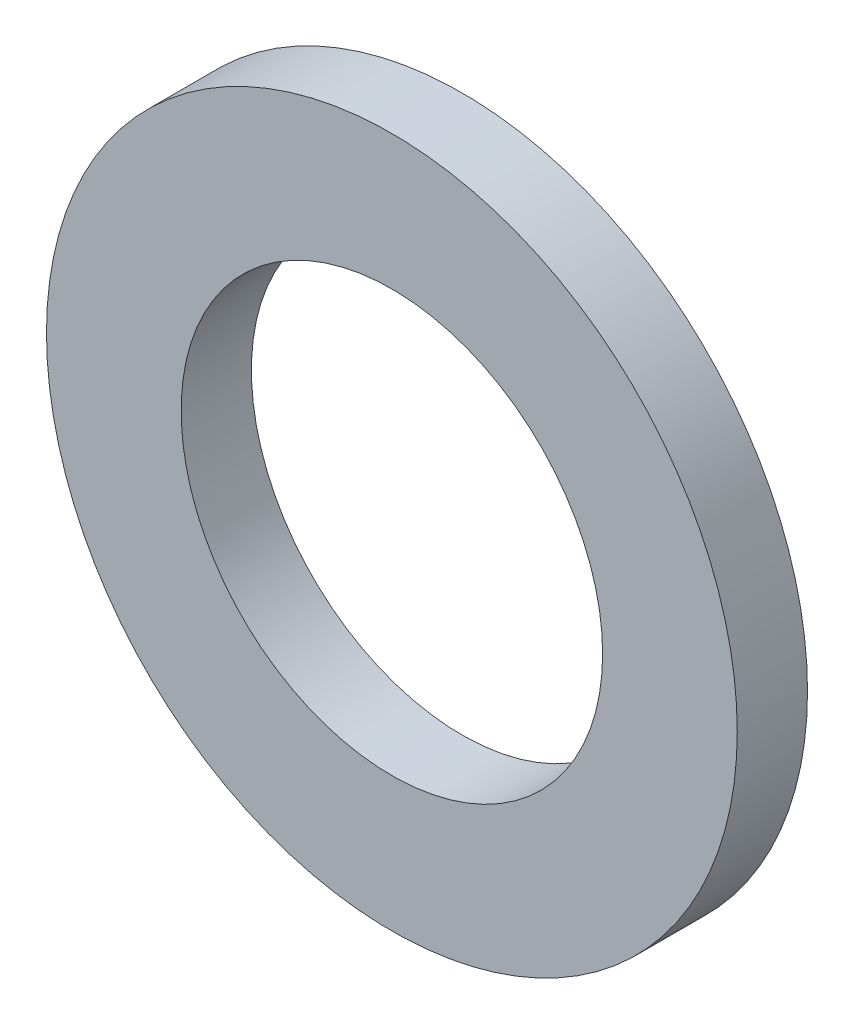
ISO-10303-21;
HEADER;
FILE_DESCRIPTION(('STEP AP214'),'2;1');
FILE_NAME('part.step','',(''),(''),'','','');
FILE_SCHEMA(('AUTOMOTIVE_DESIGN { 1 0 10303 214 1 1 1 1 }'));
ENDSEC;
DATA;
#1=APPLICATION_CONTEXT('core data for automotive mechanical design processes');
#2=APPLICATION_PROTOCOL_DEFINITION('international standard','automotive_design',2000,#1);
#3=PRODUCT_CONTEXT('',#1,'mechanical');
#4=PRODUCT('Part','Part','',(#3));
#5=PRODUCT_RELATED_PRODUCT_CATEGORY('part','',(#4));
#6=PRODUCT_DEFINITION_FORMATION('','',#4);
#7=PRODUCT_DEFINITION_CONTEXT('part definition',#1,'design');
#8=PRODUCT_DEFINITION('design','',#6,#7);
#9=PRODUCT_DEFINITION_SHAPE('','',#8);
#10=(LENGTH_UNIT() NAMED_UNIT(*) SI_UNIT(.MILLI.,.METRE.));
#11=(NAMED_UNIT(*) PLANE_ANGLE_UNIT() SI_UNIT($,.RADIAN.));
#12=(NAMED_UNIT(*) SI_UNIT($,.STERADIAN.) SOLID_ANGLE_UNIT());
#13=UNCERTAINTY_MEASURE_WITH_UNIT(LENGTH_MEASURE(1.E-05),#10,'distance_accuracy_value','');
#14=(GEOMETRIC_REPRESENTATION_CONTEXT(3) GLOBAL_UNCERTAINTY_ASSIGNED_CONTEXT((#13)) GLOBAL_UNIT_ASSIGNED_CONTEXT((#10,
#11,#12)) REPRESENTATION_CONTEXT('',''));
#15=CARTESIAN_POINT('',(0.,0.,0.));
#16=DIRECTION('',(0.,0.,1.));
#17=DIRECTION('',(1.,0.,0.));
#18=AXIS2_PLACEMENT_3D('',#15,#16,#17);
#19=CARTESIAN_POINT('',(0.,0.,3.));
#20=DIRECTION('',(0.,0.,1.));
#21=DIRECTION('',(1.,0.,0.));
#22=AXIS2_PLACEMENT_3D('',#19,#20,#21);
#23=PLANE('',#22);
#24=CARTESIAN_POINT('',(0.,0.,3.));
#25=DIRECTION('',(0.,0.,1.));
#26=DIRECTION('',(1.,0.,0.));
#27=AXIS2_PLACEMENT_3D('',#24,#25,#26);
#28=CIRCLE('',#27,14.75);
#29=CARTESIAN_POINT('',(14.75,0.,3.));
#30=VERTEX_POINT('',#29);
#31=EDGE_CURVE('E10',#30,#30,#28,.T.);
#32=ORIENTED_EDGE('',*,*,#31,.T.);
#33=EDGE_LOOP('',(#32));
#34=FACE_BOUND('',#33,.T.);
#35=CARTESIAN_POINT('',(0.,0.,3.));
#36=DIRECTION('',(0.,0.,1.));
#37=DIRECTION('',(1.,0.,0.));
#38=AXIS2_PLACEMENT_3D('',#35,#36,#37);
#39=CIRCLE('',#38,9.);
#40=CARTESIAN_POINT('',(9.,0.,3.));
#41=VERTEX_POINT('',#40);
#42=EDGE_CURVE('E41',#41,#41,#39,.T.);
#43=ORIENTED_EDGE('',*,*,#42,.F.);
#44=EDGE_LOOP('',(#43));
#45=FACE_BOUND('',#44,.T.);
#46=ADVANCED_FACE('F30',(#34,#45),#23,.T.);
#47=CARTESIAN_POINT('',(0.,0.,0.));
#48=DIRECTION('',(0.,0.,1.));
#49=DIRECTION('',(1.,0.,0.));
#50=AXIS2_PLACEMENT_3D('',#47,#48,#49);
#51=PLANE('',#50);
#52=CARTESIAN_POINT('',(0.,0.,0.));
#53=DIRECTION('',(0.,0.,1.));
#54=DIRECTION('',(1.,0.,0.));
#55=AXIS2_PLACEMENT_3D('',#52,#53,#54);
#56=CIRCLE('',#55,14.75);
#57=CARTESIAN_POINT('',(14.75,0.,0.));
#58=VERTEX_POINT('',#57);
#59=EDGE_CURVE('E34',#58,#58,#56,.T.);
#60=ORIENTED_EDGE('',*,*,#59,.F.);
#61=EDGE_LOOP('',(#60));
#62=FACE_BOUND('',#61,.T.);
#63=CARTESIAN_POINT('',(0.,0.,0.));
#64=DIRECTION('',(0.,0.,1.));
#65=DIRECTION('',(1.,0.,0.));
#66=AXIS2_PLACEMENT_3D('',#63,#64,#65);
#67=CIRCLE('',#66,9.);
#68=CARTESIAN_POINT('',(9.,0.,0.));
#69=VERTEX_POINT('',#68);
#70=EDGE_CURVE('E43',#69,#69,#67,.T.);
#71=ORIENTED_EDGE('',*,*,#70,.T.);
#72=EDGE_LOOP('',(#71));
#73=FACE_BOUND('',#72,.T.);
#74=ADVANCED_FACE('F53',(#62,#73),#51,.F.);
#75=CARTESIAN_POINT('',(0.,0.,3.));
#76=DIRECTION('',(0.,0.,-1.));
#77=DIRECTION('',(-1.,0.,0.));
#78=AXIS2_PLACEMENT_3D('',#75,#76,#77);
#79=CYLINDRICAL_SURFACE('',#78,14.75);
#80=ORIENTED_EDGE('',*,*,#31,.F.);
#81=EDGE_LOOP('',(#80));
#82=FACE_BOUND('',#81,.T.);
#83=ORIENTED_EDGE('',*,*,#59,.T.);
#84=EDGE_LOOP('',(#83));
#85=FACE_BOUND('',#84,.T.);
#86=ADVANCED_FACE('F32',(#82,#85),#79,.T.);
#87=CARTESIAN_POINT('',(0.,0.,3.));
#88=DIRECTION('',(0.,0.,-1.));
#89=DIRECTION('',(-1.,0.,0.));
#90=AXIS2_PLACEMENT_3D('',#87,#88,#89);
#91=CYLINDRICAL_SURFACE('',#90,9.);
#92=ORIENTED_EDGE('',*,*,#42,.T.);
#93=EDGE_LOOP('',(#92));
#94=FACE_BOUND('',#93,.T.);
#95=ORIENTED_EDGE('',*,*,#70,.F.);
#96=EDGE_LOOP('',(#95));
#97=FACE_BOUND('',#96,.T.);
#98=ADVANCED_FACE('F49',(#94,#97),#91,.F.);
#99=CLOSED_SHELL('',(#46,#74,#86,#98));
#100=MANIFOLD_SOLID_BREP('B2',#99);
#101=ADVANCED_BREP_SHAPE_REPRESENTATION('',(#18,#100),#14);
#102=SHAPE_DEFINITION_REPRESENTATION(#9,#101);
ENDSEC;
END-ISO-10303-21;
